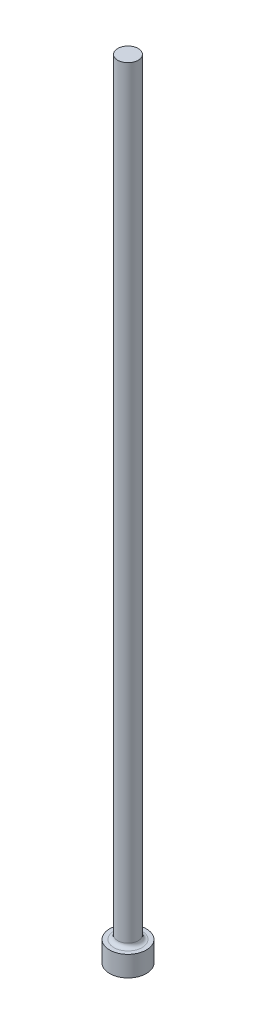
from build123d import *


with BuildPart() as part:
    # Sketch1 → Revolve1 (revolve)
    with BuildSketch(Plane.XY, mode=Mode.PRIVATE) as revolve1_sk:
        with BuildLine():
            Line((0, 0), (3.556, 0))
            Line((3.556, 0), (3.556, 3.9624))
            Line((3.556, 3.9624), (2.74574, 3.9624))
            ThreePointArc((2.74574, 3.9624), (2.206924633, 4.185584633), (1.98374, 4.7244))
            Line((1.98374, 4.7244), (1.98374, 152.4))
            Line((1.98374, 152.4), (0, 152.4))
            Line((0, 152.4), (0, 0))
        make_face()
    revolve(revolve1_sk.sketch.rotate(Axis((0, 152.4, 0), (0, -1, 0)), 180), axis=Axis((0, 152.4, 0), (0, -1, 0)))


solid = part.part
